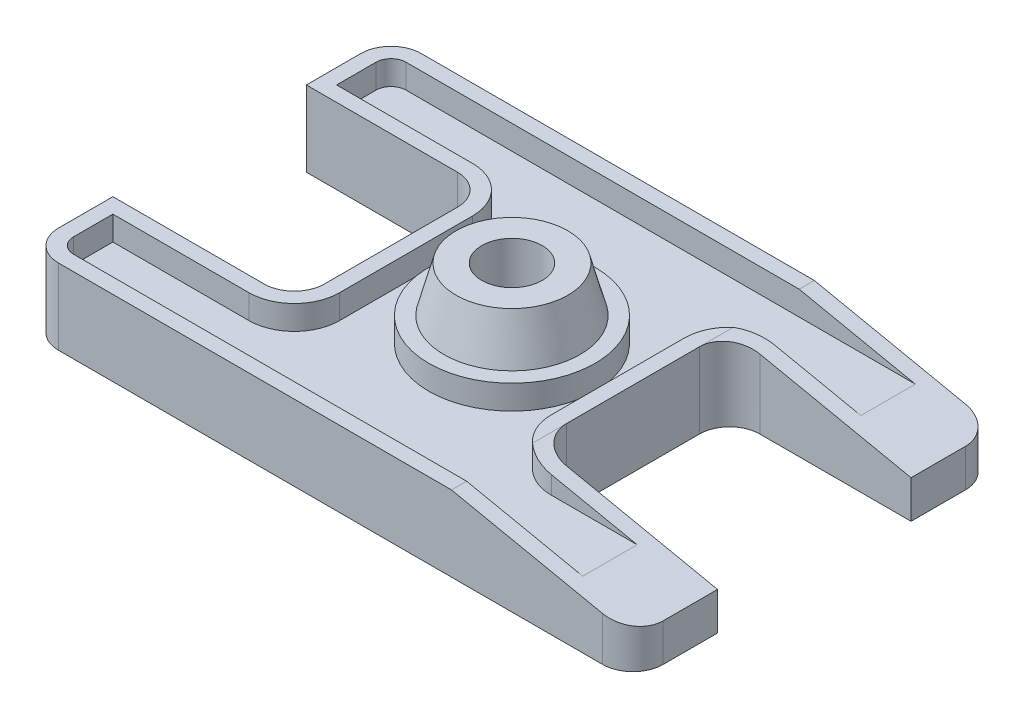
ISO-10303-21;
HEADER;
FILE_DESCRIPTION(('STEP AP214'),'2;1');
FILE_NAME('part.step','',(''),(''),'','','');
FILE_SCHEMA(('AUTOMOTIVE_DESIGN { 1 0 10303 214 1 1 1 1 }'));
ENDSEC;
DATA;
#1=APPLICATION_CONTEXT('core data for automotive mechanical design processes');
#2=APPLICATION_PROTOCOL_DEFINITION('international standard','automotive_design',2000,#1);
#3=PRODUCT_CONTEXT('',#1,'mechanical');
#4=PRODUCT('Part','Part','',(#3));
#5=PRODUCT_RELATED_PRODUCT_CATEGORY('part','',(#4));
#6=PRODUCT_DEFINITION_FORMATION('','',#4);
#7=PRODUCT_DEFINITION_CONTEXT('part definition',#1,'design');
#8=PRODUCT_DEFINITION('design','',#6,#7);
#9=PRODUCT_DEFINITION_SHAPE('','',#8);
#10=(LENGTH_UNIT() NAMED_UNIT(*) SI_UNIT(.MILLI.,.METRE.));
#11=(NAMED_UNIT(*) PLANE_ANGLE_UNIT() SI_UNIT($,.RADIAN.));
#12=(NAMED_UNIT(*) SI_UNIT($,.STERADIAN.) SOLID_ANGLE_UNIT());
#13=UNCERTAINTY_MEASURE_WITH_UNIT(LENGTH_MEASURE(1.E-05),#10,'distance_accuracy_value','');
#14=(GEOMETRIC_REPRESENTATION_CONTEXT(3) GLOBAL_UNCERTAINTY_ASSIGNED_CONTEXT((#13)) GLOBAL_UNIT_ASSIGNED_CONTEXT((#10,
#11,#12)) REPRESENTATION_CONTEXT('',''));
#15=CARTESIAN_POINT('',(0.,0.,0.));
#16=DIRECTION('',(0.,0.,1.));
#17=DIRECTION('',(1.,0.,0.));
#18=AXIS2_PLACEMENT_3D('',#15,#16,#17);
#19=CARTESIAN_POINT('',(-90.,25.,-50.));
#20=DIRECTION('',(0.,-1.,0.));
#21=DIRECTION('',(0.,0.,-1.));
#22=AXIS2_PLACEMENT_3D('',#19,#20,#21);
#23=PLANE('',#22);
#24=DIRECTION('',(1.,0.,0.));
#25=VECTOR('',#24,1.);
#26=CARTESIAN_POINT('',(-89.9999999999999,25.,60.));
#27=LINE('',#26,#25);
#28=CARTESIAN_POINT('',(-89.9999999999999,25.,60.));
#29=VERTEX_POINT('',#28);
#30=CARTESIAN_POINT('',(40.,25.,60.));
#31=VERTEX_POINT('',#30);
#32=EDGE_CURVE('E304',#29,#31,#27,.T.);
#33=ORIENTED_EDGE('',*,*,#32,.T.);
#34=DIRECTION('',(0.,0.,1.));
#35=VECTOR('',#34,1.);
#36=CARTESIAN_POINT('',(40.,25.,-60.));
#37=LINE('',#36,#35);
#38=CARTESIAN_POINT('',(40.,25.,55.));
#39=VERTEX_POINT('',#38);
#40=EDGE_CURVE('E285',#39,#31,#37,.T.);
#41=ORIENTED_EDGE('',*,*,#40,.F.);
#42=DIRECTION('',(1.,0.,0.));
#43=VECTOR('',#42,1.);
#44=CARTESIAN_POINT('',(-90.,25.,55.));
#45=LINE('',#44,#43);
#46=CARTESIAN_POINT('',(-90.,25.,55.));
#47=VERTEX_POINT('',#46);
#48=EDGE_CURVE('E511',#47,#39,#45,.T.);
#49=ORIENTED_EDGE('',*,*,#48,.F.);
#50=CARTESIAN_POINT('',(-90.,25.,50.));
#51=DIRECTION('',(0.,1.,0.));
#52=DIRECTION('',(0.,0.,1.));
#53=AXIS2_PLACEMENT_3D('',#50,#51,#52);
#54=CIRCLE('',#53,4.99999999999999);
#55=CARTESIAN_POINT('',(-95.,25.,49.9999999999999));
#56=VERTEX_POINT('',#55);
#57=EDGE_CURVE('E513',#56,#47,#54,.T.);
#58=ORIENTED_EDGE('',*,*,#57,.F.);
#59=DIRECTION('',(0.,0.,1.));
#60=VECTOR('',#59,1.);
#61=CARTESIAN_POINT('',(-95.,25.,37.));
#62=LINE('',#61,#60);
#63=CARTESIAN_POINT('',(-95.,25.,37.));
#64=VERTEX_POINT('',#63);
#65=EDGE_CURVE('E516',#64,#56,#62,.T.);
#66=ORIENTED_EDGE('',*,*,#65,.F.);
#67=DIRECTION('',(-1.,0.,0.));
#68=VECTOR('',#67,1.);
#69=CARTESIAN_POINT('',(-50.,25.,37.));
#70=LINE('',#69,#68);
#71=CARTESIAN_POINT('',(-50.,25.,37.));
#72=VERTEX_POINT('',#71);
#73=EDGE_CURVE('E519',#72,#64,#70,.T.);
#74=ORIENTED_EDGE('',*,*,#73,.F.);
#75=CARTESIAN_POINT('',(-50.,25.,22.));
#76=DIRECTION('',(0.,-1.,0.));
#77=DIRECTION('',(0.,0.,1.));
#78=AXIS2_PLACEMENT_3D('',#75,#76,#77);
#79=CIRCLE('',#78,15.);
#80=CARTESIAN_POINT('',(-35.,25.,22.));
#81=VERTEX_POINT('',#80);
#82=EDGE_CURVE('E522',#81,#72,#79,.T.);
#83=ORIENTED_EDGE('',*,*,#82,.F.);
#84=DIRECTION('',(0.,0.,1.));
#85=VECTOR('',#84,1.);
#86=CARTESIAN_POINT('',(-35.,25.,-22.));
#87=LINE('',#86,#85);
#88=CARTESIAN_POINT('',(-35.,25.,-22.));
#89=VERTEX_POINT('',#88);
#90=EDGE_CURVE('E525',#89,#81,#87,.T.);
#91=ORIENTED_EDGE('',*,*,#90,.F.);
#92=CARTESIAN_POINT('',(-50.,25.,-22.));
#93=DIRECTION('',(0.,-1.,0.));
#94=DIRECTION('',(0.,0.,1.));
#95=AXIS2_PLACEMENT_3D('',#92,#93,#94);
#96=CIRCLE('',#95,15.);
#97=CARTESIAN_POINT('',(-50.,25.,-37.));
#98=VERTEX_POINT('',#97);
#99=EDGE_CURVE('E528',#98,#89,#96,.T.);
#100=ORIENTED_EDGE('',*,*,#99,.F.);
#101=DIRECTION('',(1.,0.,0.));
#102=VECTOR('',#101,1.);
#103=CARTESIAN_POINT('',(-95.,25.,-37.));
#104=LINE('',#103,#102);
#105=CARTESIAN_POINT('',(-95.,25.,-37.));
#106=VERTEX_POINT('',#105);
#107=EDGE_CURVE('E531',#106,#98,#104,.T.);
#108=ORIENTED_EDGE('',*,*,#107,.F.);
#109=DIRECTION('',(0.,0.,1.));
#110=VECTOR('',#109,1.);
#111=CARTESIAN_POINT('',(-95.,25.,-50.));
#112=LINE('',#111,#110);
#113=CARTESIAN_POINT('',(-95.,25.,-50.));
#114=VERTEX_POINT('',#113);
#115=EDGE_CURVE('E534',#114,#106,#112,.T.);
#116=ORIENTED_EDGE('',*,*,#115,.F.);
#117=CARTESIAN_POINT('',(-90.,25.,-50.));
#118=DIRECTION('',(0.,1.,0.));
#119=DIRECTION('',(0.,0.,1.));
#120=AXIS2_PLACEMENT_3D('',#117,#118,#119);
#121=CIRCLE('',#120,5.);
#122=CARTESIAN_POINT('',(-90.,25.,-55.));
#123=VERTEX_POINT('',#122);
#124=EDGE_CURVE('E537',#123,#114,#121,.T.);
#125=ORIENTED_EDGE('',*,*,#124,.F.);
#126=DIRECTION('',(-1.,0.,0.));
#127=VECTOR('',#126,1.);
#128=CARTESIAN_POINT('',(90.,25.,-55.));
#129=LINE('',#128,#127);
#130=CARTESIAN_POINT('',(40.,25.,-55.));
#131=VERTEX_POINT('',#130);
#132=EDGE_CURVE('E500',#131,#123,#129,.T.);
#133=ORIENTED_EDGE('',*,*,#132,.F.);
#134=CARTESIAN_POINT('',(40.,25.,-60.));
#135=VERTEX_POINT('',#134);
#136=EDGE_CURVE('E299',#135,#131,#37,.T.);
#137=ORIENTED_EDGE('',*,*,#136,.F.);
#138=DIRECTION('',(1.,0.,0.));
#139=VECTOR('',#138,1.);
#140=CARTESIAN_POINT('',(-89.9999999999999,25.,-60.));
#141=LINE('',#140,#139);
#142=CARTESIAN_POINT('',(-89.9999999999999,25.,-60.));
#143=VERTEX_POINT('',#142);
#144=EDGE_CURVE('E317',#143,#135,#141,.T.);
#145=ORIENTED_EDGE('',*,*,#144,.F.);
#146=CARTESIAN_POINT('',(-90.,25.,-50.));
#147=DIRECTION('',(0.,-1.,0.));
#148=DIRECTION('',(0.,0.,-1.));
#149=AXIS2_PLACEMENT_3D('',#146,#147,#148);
#150=CIRCLE('',#149,10.);
#151=CARTESIAN_POINT('',(-100.,25.,-49.9999999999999));
#152=VERTEX_POINT('',#151);
#153=EDGE_CURVE('E397',#152,#143,#150,.T.);
#154=ORIENTED_EDGE('',*,*,#153,.F.);
#155=DIRECTION('',(0.,0.,-1.));
#156=VECTOR('',#155,1.);
#157=CARTESIAN_POINT('',(-100.,25.,-32.));
#158=LINE('',#157,#156);
#159=CARTESIAN_POINT('',(-100.,25.,-32.));
#160=VERTEX_POINT('',#159);
#161=EDGE_CURVE('E335',#160,#152,#158,.T.);
#162=ORIENTED_EDGE('',*,*,#161,.F.);
#163=DIRECTION('',(1.,0.,0.));
#164=VECTOR('',#163,1.);
#165=CARTESIAN_POINT('',(-100.,25.,-32.));
#166=LINE('',#165,#164);
#167=CARTESIAN_POINT('',(-50.,25.,-32.));
#168=VERTEX_POINT('',#167);
#169=EDGE_CURVE('E333',#160,#168,#166,.T.);
#170=ORIENTED_EDGE('',*,*,#169,.T.);
#171=CARTESIAN_POINT('',(-50.,25.,-22.));
#172=DIRECTION('',(0.,-1.,0.));
#173=DIRECTION('',(0.,0.,-1.));
#174=AXIS2_PLACEMENT_3D('',#171,#172,#173);
#175=CIRCLE('',#174,10.);
#176=CARTESIAN_POINT('',(-40.,25.,-22.));
#177=VERTEX_POINT('',#176);
#178=EDGE_CURVE('E331',#168,#177,#175,.T.);
#179=ORIENTED_EDGE('',*,*,#178,.T.);
#180=DIRECTION('',(0.,0.,1.));
#181=VECTOR('',#180,1.);
#182=CARTESIAN_POINT('',(-40.,25.,-22.));
#183=LINE('',#182,#181);
#184=CARTESIAN_POINT('',(-40.,25.,22.));
#185=VERTEX_POINT('',#184);
#186=EDGE_CURVE('E329',#177,#185,#183,.T.);
#187=ORIENTED_EDGE('',*,*,#186,.T.);
#188=CARTESIAN_POINT('',(-50.,25.,22.));
#189=DIRECTION('',(0.,1.,0.));
#190=DIRECTION('',(0.,0.,1.));
#191=AXIS2_PLACEMENT_3D('',#188,#189,#190);
#192=CIRCLE('',#191,10.);
#193=CARTESIAN_POINT('',(-50.,25.,32.));
#194=VERTEX_POINT('',#193);
#195=EDGE_CURVE('E326',#194,#185,#192,.T.);
#196=ORIENTED_EDGE('',*,*,#195,.F.);
#197=DIRECTION('',(1.,0.,0.));
#198=VECTOR('',#197,1.);
#199=CARTESIAN_POINT('',(-100.,25.,32.));
#200=LINE('',#199,#198);
#201=CARTESIAN_POINT('',(-100.,25.,32.));
#202=VERTEX_POINT('',#201);
#203=EDGE_CURVE('E323',#202,#194,#200,.T.);
#204=ORIENTED_EDGE('',*,*,#203,.F.);
#205=DIRECTION('',(0.,0.,-1.));
#206=VECTOR('',#205,1.);
#207=CARTESIAN_POINT('',(-100.,25.,49.9999999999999));
#208=LINE('',#207,#206);
#209=CARTESIAN_POINT('',(-100.,25.,49.9999999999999));
#210=VERTEX_POINT('',#209);
#211=EDGE_CURVE('E314',#210,#202,#208,.T.);
#212=ORIENTED_EDGE('',*,*,#211,.F.);
#213=CARTESIAN_POINT('',(-90.,25.,50.));
#214=DIRECTION('',(0.,-1.,0.));
#215=DIRECTION('',(0.,0.,-1.));
#216=AXIS2_PLACEMENT_3D('',#213,#214,#215);
#217=CIRCLE('',#216,10.);
#218=EDGE_CURVE('E311',#29,#210,#217,.T.);
#219=ORIENTED_EDGE('',*,*,#218,.F.);
#220=EDGE_LOOP('',(#33,#41,#49,#58,#66,#74,#83,#91,#100,#108,#116,#125,#133,#137,#145,#154,#162,
#170,#179,#187,#196,#204,#212,#219));
#221=FACE_BOUND('',#220,.T.);
#222=ADVANCED_FACE('F37',(#221),#23,.F.);
#223=CARTESIAN_POINT('',(-90.,0.,-50.));
#224=DIRECTION('',(0.,-1.,0.));
#225=DIRECTION('',(0.,0.,-1.));
#226=AXIS2_PLACEMENT_3D('',#223,#224,#225);
#227=PLANE('',#226);
#228=CARTESIAN_POINT('',(-90.,0.,-50.));
#229=DIRECTION('',(0.,-1.,0.));
#230=DIRECTION('',(0.,0.,-1.));
#231=AXIS2_PLACEMENT_3D('',#228,#229,#230);
#232=CIRCLE('',#231,10.);
#233=CARTESIAN_POINT('',(-100.,0.,-49.9999999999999));
#234=VERTEX_POINT('',#233);
#235=CARTESIAN_POINT('',(-89.9999999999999,0.,-60.));
#236=VERTEX_POINT('',#235);
#237=EDGE_CURVE('E339',#234,#236,#232,.T.);
#238=ORIENTED_EDGE('',*,*,#237,.T.);
#239=DIRECTION('',(1.,0.,0.));
#240=VECTOR('',#239,1.);
#241=CARTESIAN_POINT('',(-89.9999999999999,0.,-60.));
#242=LINE('',#241,#240);
#243=CARTESIAN_POINT('',(89.9999999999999,0.,-60.));
#244=VERTEX_POINT('',#243);
#245=EDGE_CURVE('E342',#236,#244,#242,.T.);
#246=ORIENTED_EDGE('',*,*,#245,.T.);
#247=CARTESIAN_POINT('',(90.,0.,-50.));
#248=DIRECTION('',(0.,-1.,0.));
#249=DIRECTION('',(0.,0.,-1.));
#250=AXIS2_PLACEMENT_3D('',#247,#248,#249);
#251=CIRCLE('',#250,10.);
#252=CARTESIAN_POINT('',(100.,0.,-49.9999999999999));
#253=VERTEX_POINT('',#252);
#254=EDGE_CURVE('E346',#244,#253,#251,.T.);
#255=ORIENTED_EDGE('',*,*,#254,.T.);
#256=DIRECTION('',(0.,0.,-1.));
#257=VECTOR('',#256,1.);
#258=CARTESIAN_POINT('',(100.,0.,-32.));
#259=LINE('',#258,#257);
#260=CARTESIAN_POINT('',(100.,0.,-32.));
#261=VERTEX_POINT('',#260);
#262=EDGE_CURVE('E349',#261,#253,#259,.T.);
#263=ORIENTED_EDGE('',*,*,#262,.F.);
#264=DIRECTION('',(-1.,0.,0.));
#265=VECTOR('',#264,1.);
#266=CARTESIAN_POINT('',(100.,0.,-32.));
#267=LINE('',#266,#265);
#268=CARTESIAN_POINT('',(50.,0.,-32.));
#269=VERTEX_POINT('',#268);
#270=EDGE_CURVE('E352',#261,#269,#267,.T.);
#271=ORIENTED_EDGE('',*,*,#270,.T.);
#272=CARTESIAN_POINT('',(50.,0.,-22.));
#273=DIRECTION('',(0.,1.,0.));
#274=DIRECTION('',(0.,0.,1.));
#275=AXIS2_PLACEMENT_3D('',#272,#273,#274);
#276=CIRCLE('',#275,10.);
#277=CARTESIAN_POINT('',(40.,0.,-22.));
#278=VERTEX_POINT('',#277);
#279=EDGE_CURVE('E355',#269,#278,#276,.T.);
#280=ORIENTED_EDGE('',*,*,#279,.T.);
#281=DIRECTION('',(0.,0.,1.));
#282=VECTOR('',#281,1.);
#283=CARTESIAN_POINT('',(40.,0.,-22.));
#284=LINE('',#283,#282);
#285=CARTESIAN_POINT('',(40.,0.,22.));
#286=VERTEX_POINT('',#285);
#287=EDGE_CURVE('E358',#278,#286,#284,.T.);
#288=ORIENTED_EDGE('',*,*,#287,.T.);
#289=CARTESIAN_POINT('',(50.,0.,22.));
#290=DIRECTION('',(0.,-1.,0.));
#291=DIRECTION('',(0.,0.,-1.));
#292=AXIS2_PLACEMENT_3D('',#289,#290,#291);
#293=CIRCLE('',#292,10.);
#294=CARTESIAN_POINT('',(50.,0.,32.));
#295=VERTEX_POINT('',#294);
#296=EDGE_CURVE('E361',#295,#286,#293,.T.);
#297=ORIENTED_EDGE('',*,*,#296,.F.);
#298=DIRECTION('',(-1.,0.,0.));
#299=VECTOR('',#298,1.);
#300=CARTESIAN_POINT('',(100.,0.,32.));
#301=LINE('',#300,#299);
#302=CARTESIAN_POINT('',(100.,0.,32.));
#303=VERTEX_POINT('',#302);
#304=EDGE_CURVE('E364',#303,#295,#301,.T.);
#305=ORIENTED_EDGE('',*,*,#304,.F.);
#306=DIRECTION('',(0.,0.,-1.));
#307=VECTOR('',#306,1.);
#308=CARTESIAN_POINT('',(100.,0.,49.9999999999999));
#309=LINE('',#308,#307);
#310=CARTESIAN_POINT('',(100.,0.,49.9999999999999));
#311=VERTEX_POINT('',#310);
#312=EDGE_CURVE('E367',#311,#303,#309,.T.);
#313=ORIENTED_EDGE('',*,*,#312,.F.);
#314=CARTESIAN_POINT('',(90.,0.,50.));
#315=DIRECTION('',(0.,1.,0.));
#316=DIRECTION('',(0.,0.,1.));
#317=AXIS2_PLACEMENT_3D('',#314,#315,#316);
#318=CIRCLE('',#317,10.);
#319=CARTESIAN_POINT('',(89.9999999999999,0.,60.));
#320=VERTEX_POINT('',#319);
#321=EDGE_CURVE('E370',#320,#311,#318,.T.);
#322=ORIENTED_EDGE('',*,*,#321,.F.);
#323=DIRECTION('',(1.,0.,0.));
#324=VECTOR('',#323,1.);
#325=CARTESIAN_POINT('',(-89.9999999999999,0.,60.));
#326=LINE('',#325,#324);
#327=CARTESIAN_POINT('',(-89.9999999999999,0.,60.));
#328=VERTEX_POINT('',#327);
#329=EDGE_CURVE('E373',#328,#320,#326,.T.);
#330=ORIENTED_EDGE('',*,*,#329,.F.);
#331=CARTESIAN_POINT('',(-90.,0.,50.));
#332=DIRECTION('',(0.,-1.,0.));
#333=DIRECTION('',(0.,0.,-1.));
#334=AXIS2_PLACEMENT_3D('',#331,#332,#333);
#335=CIRCLE('',#334,10.);
#336=CARTESIAN_POINT('',(-100.,0.,49.9999999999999));
#337=VERTEX_POINT('',#336);
#338=EDGE_CURVE('E375',#328,#337,#335,.T.);
#339=ORIENTED_EDGE('',*,*,#338,.T.);
#340=DIRECTION('',(0.,0.,-1.));
#341=VECTOR('',#340,1.);
#342=CARTESIAN_POINT('',(-100.,0.,49.9999999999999));
#343=LINE('',#342,#341);
#344=CARTESIAN_POINT('',(-100.,0.,32.));
#345=VERTEX_POINT('',#344);
#346=EDGE_CURVE('E378',#337,#345,#343,.T.);
#347=ORIENTED_EDGE('',*,*,#346,.T.);
#348=DIRECTION('',(1.,0.,0.));
#349=VECTOR('',#348,1.);
#350=CARTESIAN_POINT('',(-100.,0.,32.));
#351=LINE('',#350,#349);
#352=CARTESIAN_POINT('',(-50.,0.,32.));
#353=VERTEX_POINT('',#352);
#354=EDGE_CURVE('E381',#345,#353,#351,.T.);
#355=ORIENTED_EDGE('',*,*,#354,.T.);
#356=CARTESIAN_POINT('',(-50.,0.,22.));
#357=DIRECTION('',(0.,1.,0.));
#358=DIRECTION('',(0.,0.,1.));
#359=AXIS2_PLACEMENT_3D('',#356,#357,#358);
#360=CIRCLE('',#359,10.);
#361=CARTESIAN_POINT('',(-40.,0.,22.));
#362=VERTEX_POINT('',#361);
#363=EDGE_CURVE('E384',#353,#362,#360,.T.);
#364=ORIENTED_EDGE('',*,*,#363,.T.);
#365=DIRECTION('',(0.,0.,1.));
#366=VECTOR('',#365,1.);
#367=CARTESIAN_POINT('',(-40.,0.,-22.));
#368=LINE('',#367,#366);
#369=CARTESIAN_POINT('',(-40.,0.,-22.));
#370=VERTEX_POINT('',#369);
#371=EDGE_CURVE('E387',#370,#362,#368,.T.);
#372=ORIENTED_EDGE('',*,*,#371,.F.);
#373=CARTESIAN_POINT('',(-50.,0.,-22.));
#374=DIRECTION('',(0.,-1.,0.));
#375=DIRECTION('',(0.,0.,-1.));
#376=AXIS2_PLACEMENT_3D('',#373,#374,#375);
#377=CIRCLE('',#376,10.);
#378=CARTESIAN_POINT('',(-50.,0.,-32.));
#379=VERTEX_POINT('',#378);
#380=EDGE_CURVE('E390',#379,#370,#377,.T.);
#381=ORIENTED_EDGE('',*,*,#380,.F.);
#382=DIRECTION('',(1.,0.,0.));
#383=VECTOR('',#382,1.);
#384=CARTESIAN_POINT('',(-100.,0.,-32.));
#385=LINE('',#384,#383);
#386=CARTESIAN_POINT('',(-100.,0.,-32.));
#387=VERTEX_POINT('',#386);
#388=EDGE_CURVE('E392',#387,#379,#385,.T.);
#389=ORIENTED_EDGE('',*,*,#388,.F.);
#390=DIRECTION('',(0.,0.,-1.));
#391=VECTOR('',#390,1.);
#392=CARTESIAN_POINT('',(-100.,0.,-32.));
#393=LINE('',#392,#391);
#394=EDGE_CURVE('E394',#387,#234,#393,.T.);
#395=ORIENTED_EDGE('',*,*,#394,.T.);
#396=EDGE_LOOP('',(#238,#246,#255,#263,#271,#280,#288,#297,#305,#313,#322,#330,#339,#347,#355,
#364,#372,#381,#389,#395));
#397=FACE_BOUND('',#396,.T.);
#398=CARTESIAN_POINT('',(0.,0.,0.));
#399=DIRECTION('',(0.,1.,0.));
#400=DIRECTION('',(0.,0.,1.));
#401=AXIS2_PLACEMENT_3D('',#398,#399,#400);
#402=CIRCLE('',#401,10.);
#403=CARTESIAN_POINT('',(0.,0.,10.));
#404=VERTEX_POINT('',#403);
#405=EDGE_CURVE('E590',#404,#404,#402,.T.);
#406=ORIENTED_EDGE('',*,*,#405,.T.);
#407=EDGE_LOOP('',(#406));
#408=FACE_BOUND('',#407,.T.);
#409=ADVANCED_FACE('F449',(#397,#408),#227,.T.);
#410=CARTESIAN_POINT('',(0.,40.,0.));
#411=DIRECTION('',(0.,-1.,0.));
#412=DIRECTION('',(0.,0.,-1.));
#413=AXIS2_PLACEMENT_3D('',#410,#411,#412);
#414=PLANE('',#413);
#415=CARTESIAN_POINT('',(0.,40.,0.));
#416=DIRECTION('',(0.,-1.,0.));
#417=DIRECTION('',(0.,0.,-1.));
#418=AXIS2_PLACEMENT_3D('',#415,#416,#417);
#419=CIRCLE('',#418,18.4807621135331);
#420=CARTESIAN_POINT('',(0.,40.,-18.4807621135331));
#421=VERTEX_POINT('',#420);
#422=EDGE_CURVE('E343',#421,#421,#419,.T.);
#423=ORIENTED_EDGE('',*,*,#422,.F.);
#424=EDGE_LOOP('',(#423));
#425=FACE_BOUND('',#424,.T.);
#426=CARTESIAN_POINT('',(0.,40.,0.));
#427=DIRECTION('',(0.,1.,0.));
#428=DIRECTION('',(0.,0.,1.));
#429=AXIS2_PLACEMENT_3D('',#426,#427,#428);
#430=CIRCLE('',#429,10.);
#431=CARTESIAN_POINT('',(0.,40.,10.));
#432=VERTEX_POINT('',#431);
#433=EDGE_CURVE('E587',#432,#432,#430,.T.);
#434=ORIENTED_EDGE('',*,*,#433,.F.);
#435=EDGE_LOOP('',(#434));
#436=FACE_BOUND('',#435,.T.);
#437=ADVANCED_FACE('F705',(#425,#436),#414,.F.);
#438=CARTESIAN_POINT('',(-90.,25.,-50.));
#439=DIRECTION('',(0.,-1.,0.));
#440=DIRECTION('',(0.,0.,-1.));
#441=AXIS2_PLACEMENT_3D('',#438,#439,#440);
#442=CYLINDRICAL_SURFACE('',#441,10.);
#443=ORIENTED_EDGE('',*,*,#237,.F.);
#444=DIRECTION('',(0.,-1.,0.));
#445=VECTOR('',#444,1.);
#446=CARTESIAN_POINT('',(-100.,25.,-49.9999999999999));
#447=LINE('',#446,#445);
#448=EDGE_CURVE('E398',#152,#234,#447,.T.);
#449=ORIENTED_EDGE('',*,*,#448,.F.);
#450=ORIENTED_EDGE('',*,*,#153,.T.);
#451=DIRECTION('',(0.,-1.,0.));
#452=VECTOR('',#451,1.);
#453=CARTESIAN_POINT('',(-89.9999999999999,25.,-60.));
#454=LINE('',#453,#452);
#455=EDGE_CURVE('E338',#143,#236,#454,.T.);
#456=ORIENTED_EDGE('',*,*,#455,.T.);
#457=EDGE_LOOP('',(#443,#449,#450,#456));
#458=FACE_BOUND('',#457,.T.);
#459=ADVANCED_FACE('F39',(#458),#442,.T.);
#460=CARTESIAN_POINT('',(-100.,25.,-32.));
#461=DIRECTION('',(-1.,0.,0.));
#462=DIRECTION('',(0.,0.,1.));
#463=AXIS2_PLACEMENT_3D('',#460,#461,#462);
#464=PLANE('',#463);
#465=ORIENTED_EDGE('',*,*,#394,.F.);
#466=DIRECTION('',(0.,-1.,0.));
#467=VECTOR('',#466,1.);
#468=CARTESIAN_POINT('',(-100.,25.,-32.));
#469=LINE('',#468,#467);
#470=EDGE_CURVE('E400',#160,#387,#469,.T.);
#471=ORIENTED_EDGE('',*,*,#470,.F.);
#472=ORIENTED_EDGE('',*,*,#161,.T.);
#473=ORIENTED_EDGE('',*,*,#448,.T.);
#474=EDGE_LOOP('',(#465,#471,#472,#473));
#475=FACE_BOUND('',#474,.T.);
#476=ADVANCED_FACE('F455',(#475),#464,.T.);
#477=CARTESIAN_POINT('',(-100.,25.,-32.));
#478=DIRECTION('',(0.,0.,-1.));
#479=DIRECTION('',(-1.,0.,0.));
#480=AXIS2_PLACEMENT_3D('',#477,#478,#479);
#481=PLANE('',#480);
#482=ORIENTED_EDGE('',*,*,#388,.T.);
#483=DIRECTION('',(0.,-1.,0.));
#484=VECTOR('',#483,1.);
#485=CARTESIAN_POINT('',(-50.,25.,-32.));
#486=LINE('',#485,#484);
#487=EDGE_CURVE('E402',#168,#379,#486,.T.);
#488=ORIENTED_EDGE('',*,*,#487,.F.);
#489=ORIENTED_EDGE('',*,*,#169,.F.);
#490=ORIENTED_EDGE('',*,*,#470,.T.);
#491=EDGE_LOOP('',(#482,#488,#489,#490));
#492=FACE_BOUND('',#491,.T.);
#493=ADVANCED_FACE('F689',(#492),#481,.F.);
#494=CARTESIAN_POINT('',(-50.,25.,-22.));
#495=DIRECTION('',(0.,-1.,0.));
#496=DIRECTION('',(0.,0.,-1.));
#497=AXIS2_PLACEMENT_3D('',#494,#495,#496);
#498=CYLINDRICAL_SURFACE('',#497,10.);
#499=ORIENTED_EDGE('',*,*,#380,.T.);
#500=DIRECTION('',(0.,-1.,0.));
#501=VECTOR('',#500,1.);
#502=CARTESIAN_POINT('',(-40.,25.,-22.));
#503=LINE('',#502,#501);
#504=EDGE_CURVE('E405',#177,#370,#503,.T.);
#505=ORIENTED_EDGE('',*,*,#504,.F.);
#506=ORIENTED_EDGE('',*,*,#178,.F.);
#507=ORIENTED_EDGE('',*,*,#487,.T.);
#508=EDGE_LOOP('',(#499,#505,#506,#507));
#509=FACE_BOUND('',#508,.T.);
#510=ADVANCED_FACE('F685',(#509),#498,.F.);
#511=CARTESIAN_POINT('',(-40.,25.,-22.));
#512=DIRECTION('',(1.,0.,0.));
#513=DIRECTION('',(0.,0.,-1.));
#514=AXIS2_PLACEMENT_3D('',#511,#512,#513);
#515=PLANE('',#514);
#516=ORIENTED_EDGE('',*,*,#371,.T.);
#517=DIRECTION('',(0.,-1.,0.));
#518=VECTOR('',#517,1.);
#519=CARTESIAN_POINT('',(-40.,25.,22.));
#520=LINE('',#519,#518);
#521=EDGE_CURVE('E408',#185,#362,#520,.T.);
#522=ORIENTED_EDGE('',*,*,#521,.F.);
#523=ORIENTED_EDGE('',*,*,#186,.F.);
#524=ORIENTED_EDGE('',*,*,#504,.T.);
#525=EDGE_LOOP('',(#516,#522,#523,#524));
#526=FACE_BOUND('',#525,.T.);
#527=ADVANCED_FACE('F682',(#526),#515,.F.);
#528=CARTESIAN_POINT('',(-50.,25.,22.));
#529=DIRECTION('',(0.,-1.,0.));
#530=DIRECTION('',(0.,0.,-1.));
#531=AXIS2_PLACEMENT_3D('',#528,#529,#530);
#532=CYLINDRICAL_SURFACE('',#531,10.);
#533=ORIENTED_EDGE('',*,*,#363,.F.);
#534=DIRECTION('',(0.,-1.,0.));
#535=VECTOR('',#534,1.);
#536=CARTESIAN_POINT('',(-50.,25.,32.));
#537=LINE('',#536,#535);
#538=EDGE_CURVE('E410',#194,#353,#537,.T.);
#539=ORIENTED_EDGE('',*,*,#538,.F.);
#540=ORIENTED_EDGE('',*,*,#195,.T.);
#541=ORIENTED_EDGE('',*,*,#521,.T.);
#542=EDGE_LOOP('',(#533,#539,#540,#541));
#543=FACE_BOUND('',#542,.T.);
#544=ADVANCED_FACE('F678',(#543),#532,.F.);
#545=CARTESIAN_POINT('',(-100.,25.,32.));
#546=DIRECTION('',(0.,0.,-1.));
#547=DIRECTION('',(-1.,0.,0.));
#548=AXIS2_PLACEMENT_3D('',#545,#546,#547);
#549=PLANE('',#548);
#550=ORIENTED_EDGE('',*,*,#354,.F.);
#551=DIRECTION('',(0.,-1.,0.));
#552=VECTOR('',#551,1.);
#553=CARTESIAN_POINT('',(-100.,25.,32.));
#554=LINE('',#553,#552);
#555=EDGE_CURVE('E412',#202,#345,#554,.T.);
#556=ORIENTED_EDGE('',*,*,#555,.F.);
#557=ORIENTED_EDGE('',*,*,#203,.T.);
#558=ORIENTED_EDGE('',*,*,#538,.T.);
#559=EDGE_LOOP('',(#550,#556,#557,#558));
#560=FACE_BOUND('',#559,.T.);
#561=ADVANCED_FACE('F674',(#560),#549,.T.);
#562=CARTESIAN_POINT('',(-100.,25.,49.9999999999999));
#563=DIRECTION('',(-1.,0.,0.));
#564=DIRECTION('',(0.,0.,1.));
#565=AXIS2_PLACEMENT_3D('',#562,#563,#564);
#566=PLANE('',#565);
#567=ORIENTED_EDGE('',*,*,#346,.F.);
#568=DIRECTION('',(0.,-1.,0.));
#569=VECTOR('',#568,1.);
#570=CARTESIAN_POINT('',(-100.,25.,49.9999999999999));
#571=LINE('',#570,#569);
#572=EDGE_CURVE('E414',#210,#337,#571,.T.);
#573=ORIENTED_EDGE('',*,*,#572,.F.);
#574=ORIENTED_EDGE('',*,*,#211,.T.);
#575=ORIENTED_EDGE('',*,*,#555,.T.);
#576=EDGE_LOOP('',(#567,#573,#574,#575));
#577=FACE_BOUND('',#576,.T.);
#578=ADVANCED_FACE('F669',(#577),#566,.T.);
#579=CARTESIAN_POINT('',(-90.,25.,50.));
#580=DIRECTION('',(0.,-1.,0.));
#581=DIRECTION('',(0.,0.,-1.));
#582=AXIS2_PLACEMENT_3D('',#579,#580,#581);
#583=CYLINDRICAL_SURFACE('',#582,10.);
#584=ORIENTED_EDGE('',*,*,#338,.F.);
#585=DIRECTION('',(0.,-1.,0.));
#586=VECTOR('',#585,1.);
#587=CARTESIAN_POINT('',(-89.9999999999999,25.,60.));
#588=LINE('',#587,#586);
#589=EDGE_CURVE('E416',#29,#328,#588,.T.);
#590=ORIENTED_EDGE('',*,*,#589,.F.);
#591=ORIENTED_EDGE('',*,*,#218,.T.);
#592=ORIENTED_EDGE('',*,*,#572,.T.);
#593=EDGE_LOOP('',(#584,#590,#591,#592));
#594=FACE_BOUND('',#593,.T.);
#595=ADVANCED_FACE('F666',(#594),#583,.T.);
#596=CARTESIAN_POINT('',(-89.9999999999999,25.,60.));
#597=DIRECTION('',(0.,0.,-1.));
#598=DIRECTION('',(-1.,0.,0.));
#599=AXIS2_PLACEMENT_3D('',#596,#597,#598);
#600=PLANE('',#599);
#601=DIRECTION('',(0.,-1.,0.));
#602=VECTOR('',#601,1.);
#603=CARTESIAN_POINT('',(89.9999999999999,25.,60.));
#604=LINE('',#603,#602);
#605=CARTESIAN_POINT('',(90.,14.5833333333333,60.));
#606=VERTEX_POINT('',#605);
#607=EDGE_CURVE('E307',#606,#320,#604,.T.);
#608=ORIENTED_EDGE('',*,*,#607,.F.);
#609=DIRECTION('',(0.978980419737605,-0.203954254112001,0.));
#610=VECTOR('',#609,1.);
#611=CARTESIAN_POINT('',(40.,25.,60.));
#612=LINE('',#611,#610);
#613=EDGE_CURVE('E288',#31,#606,#612,.T.);
#614=ORIENTED_EDGE('',*,*,#613,.F.);
#615=ORIENTED_EDGE('',*,*,#32,.F.);
#616=ORIENTED_EDGE('',*,*,#589,.T.);
#617=ORIENTED_EDGE('',*,*,#329,.T.);
#618=EDGE_LOOP('',(#608,#614,#615,#616,#617));
#619=FACE_BOUND('',#618,.T.);
#620=ADVANCED_FACE('F303',(#619),#600,.F.);
#621=CARTESIAN_POINT('',(90.,25.,50.));
#622=DIRECTION('',(0.,-1.,0.));
#623=DIRECTION('',(0.,0.,-1.));
#624=AXIS2_PLACEMENT_3D('',#621,#622,#623);
#625=CYLINDRICAL_SURFACE('',#624,10.);
#626=DIRECTION('',(0.,-1.,0.));
#627=VECTOR('',#626,1.);
#628=CARTESIAN_POINT('',(100.,25.,49.9999999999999));
#629=LINE('',#628,#627);
#630=CARTESIAN_POINT('',(100.,12.5,50.));
#631=VERTEX_POINT('',#630);
#632=EDGE_CURVE('E419',#631,#311,#629,.T.);
#633=ORIENTED_EDGE('',*,*,#632,.F.);
#634=CARTESIAN_POINT('',(90.,14.5833333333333,50.));
#635=DIRECTION('',(-0.203954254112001,-0.978980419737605,0.));
#636=DIRECTION('',(0.978980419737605,-0.203954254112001,0.));
#637=AXIS2_PLACEMENT_3D('',#634,#635,#636);
#638=ELLIPSE('',#637,10.2147088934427,10.);
#639=EDGE_CURVE('E593',#631,#606,#638,.T.);
#640=ORIENTED_EDGE('',*,*,#639,.T.);
#641=ORIENTED_EDGE('',*,*,#607,.T.);
#642=ORIENTED_EDGE('',*,*,#321,.T.);
#643=EDGE_LOOP('',(#633,#640,#641,#642));
#644=FACE_BOUND('',#643,.T.);
#645=ADVANCED_FACE('F663',(#644),#625,.T.);
#646=CARTESIAN_POINT('',(100.,25.,49.9999999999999));
#647=DIRECTION('',(-1.,0.,0.));
#648=DIRECTION('',(0.,0.,1.));
#649=AXIS2_PLACEMENT_3D('',#646,#647,#648);
#650=PLANE('',#649);
#651=DIRECTION('',(0.,-1.,0.));
#652=VECTOR('',#651,1.);
#653=CARTESIAN_POINT('',(100.,25.,32.));
#654=LINE('',#653,#652);
#655=CARTESIAN_POINT('',(100.,12.5,32.));
#656=VERTEX_POINT('',#655);
#657=EDGE_CURVE('E421',#656,#303,#654,.T.);
#658=ORIENTED_EDGE('',*,*,#657,.F.);
#659=DIRECTION('',(0.,0.,1.));
#660=VECTOR('',#659,1.);
#661=CARTESIAN_POINT('',(100.,12.5,-60.));
#662=LINE('',#661,#660);
#663=EDGE_CURVE('E622',#656,#631,#662,.T.);
#664=ORIENTED_EDGE('',*,*,#663,.T.);
#665=ORIENTED_EDGE('',*,*,#632,.T.);
#666=ORIENTED_EDGE('',*,*,#312,.T.);
#667=EDGE_LOOP('',(#658,#664,#665,#666));
#668=FACE_BOUND('',#667,.T.);
#669=ADVANCED_FACE('F660',(#668),#650,.F.);
#670=CARTESIAN_POINT('',(100.,25.,32.));
#671=DIRECTION('',(0.,0.,1.));
#672=DIRECTION('',(1.,0.,0.));
#673=AXIS2_PLACEMENT_3D('',#670,#671,#672);
#674=PLANE('',#673);
#675=DIRECTION('',(0.,-1.,0.));
#676=VECTOR('',#675,1.);
#677=CARTESIAN_POINT('',(50.,25.,32.));
#678=LINE('',#677,#676);
#679=CARTESIAN_POINT('',(50.,22.9166666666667,32.));
#680=VERTEX_POINT('',#679);
#681=EDGE_CURVE('E423',#680,#295,#678,.T.);
#682=ORIENTED_EDGE('',*,*,#681,.F.);
#683=DIRECTION('',(0.978980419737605,-0.203954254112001,0.));
#684=VECTOR('',#683,1.);
#685=CARTESIAN_POINT('',(97.5041597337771,13.0199667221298,32.));
#686=LINE('',#685,#684);
#687=EDGE_CURVE('E597',#680,#656,#686,.T.);
#688=ORIENTED_EDGE('',*,*,#687,.T.);
#689=ORIENTED_EDGE('',*,*,#657,.T.);
#690=ORIENTED_EDGE('',*,*,#304,.T.);
#691=EDGE_LOOP('',(#682,#688,#689,#690));
#692=FACE_BOUND('',#691,.T.);
#693=ADVANCED_FACE('F654',(#692),#674,.F.);
#694=CARTESIAN_POINT('',(50.,25.,22.));
#695=DIRECTION('',(0.,-1.,0.));
#696=DIRECTION('',(0.,0.,-1.));
#697=AXIS2_PLACEMENT_3D('',#694,#695,#696);
#698=CYLINDRICAL_SURFACE('',#697,10.);
#699=DIRECTION('',(0.,-1.,0.));
#700=VECTOR('',#699,1.);
#701=CARTESIAN_POINT('',(40.,25.,22.));
#702=LINE('',#701,#700);
#703=CARTESIAN_POINT('',(40.,25.,22.));
#704=VERTEX_POINT('',#703);
#705=EDGE_CURVE('E425',#704,#286,#702,.T.);
#706=ORIENTED_EDGE('',*,*,#705,.F.);
#707=CARTESIAN_POINT('',(50.,22.9166666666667,22.));
#708=DIRECTION('',(-0.203954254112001,-0.978980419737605,0.));
#709=DIRECTION('',(0.978980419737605,-0.203954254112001,0.));
#710=AXIS2_PLACEMENT_3D('',#707,#708,#709);
#711=ELLIPSE('',#710,10.2147088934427,10.);
#712=EDGE_CURVE('E600',#704,#680,#711,.F.);
#713=ORIENTED_EDGE('',*,*,#712,.T.);
#714=ORIENTED_EDGE('',*,*,#681,.T.);
#715=ORIENTED_EDGE('',*,*,#296,.T.);
#716=EDGE_LOOP('',(#706,#713,#714,#715));
#717=FACE_BOUND('',#716,.T.);
#718=ADVANCED_FACE('F651',(#717),#698,.F.);
#719=CARTESIAN_POINT('',(40.,25.,-22.));
#720=DIRECTION('',(1.,0.,0.));
#721=DIRECTION('',(0.,0.,-1.));
#722=AXIS2_PLACEMENT_3D('',#719,#720,#721);
#723=PLANE('',#722);
#724=ORIENTED_EDGE('',*,*,#287,.F.);
#725=DIRECTION('',(0.,-1.,0.));
#726=VECTOR('',#725,1.);
#727=CARTESIAN_POINT('',(40.,25.,-22.));
#728=LINE('',#727,#726);
#729=CARTESIAN_POINT('',(40.,25.,-22.));
#730=VERTEX_POINT('',#729);
#731=EDGE_CURVE('E427',#730,#278,#728,.T.);
#732=ORIENTED_EDGE('',*,*,#731,.F.);
#733=DIRECTION('',(0.,0.,1.));
#734=VECTOR('',#733,1.);
#735=CARTESIAN_POINT('',(40.,25.,-22.));
#736=LINE('',#735,#734);
#737=EDGE_CURVE('E312',#730,#704,#736,.T.);
#738=ORIENTED_EDGE('',*,*,#737,.T.);
#739=ORIENTED_EDGE('',*,*,#705,.T.);
#740=EDGE_LOOP('',(#724,#732,#738,#739));
#741=FACE_BOUND('',#740,.T.);
#742=ADVANCED_FACE('F647',(#741),#723,.T.);
#743=CARTESIAN_POINT('',(50.,25.,-22.));
#744=DIRECTION('',(0.,-1.,0.));
#745=DIRECTION('',(0.,0.,-1.));
#746=AXIS2_PLACEMENT_3D('',#743,#744,#745);
#747=CYLINDRICAL_SURFACE('',#746,10.);
#748=CARTESIAN_POINT('',(50.,22.9166666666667,-22.));
#749=DIRECTION('',(-0.203954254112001,-0.978980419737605,0.));
#750=DIRECTION('',(0.978980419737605,-0.203954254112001,0.));
#751=AXIS2_PLACEMENT_3D('',#748,#749,#750);
#752=ELLIPSE('',#751,10.2147088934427,10.);
#753=CARTESIAN_POINT('',(50.,22.9166666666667,-32.));
#754=VERTEX_POINT('',#753);
#755=EDGE_CURVE('E603',#730,#754,#752,.T.);
#756=ORIENTED_EDGE('',*,*,#755,.F.);
#757=ORIENTED_EDGE('',*,*,#731,.T.);
#758=ORIENTED_EDGE('',*,*,#279,.F.);
#759=DIRECTION('',(0.,-1.,0.));
#760=VECTOR('',#759,1.);
#761=CARTESIAN_POINT('',(50.,25.,-32.));
#762=LINE('',#761,#760);
#763=EDGE_CURVE('E429',#754,#269,#762,.T.);
#764=ORIENTED_EDGE('',*,*,#763,.F.);
#765=EDGE_LOOP('',(#756,#757,#758,#764));
#766=FACE_BOUND('',#765,.T.);
#767=ADVANCED_FACE('F641',(#766),#747,.F.);
#768=CARTESIAN_POINT('',(100.,25.,-32.));
#769=DIRECTION('',(0.,0.,1.));
#770=DIRECTION('',(1.,0.,0.));
#771=AXIS2_PLACEMENT_3D('',#768,#769,#770);
#772=PLANE('',#771);
#773=DIRECTION('',(0.978980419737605,-0.203954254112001,0.));
#774=VECTOR('',#773,1.);
#775=CARTESIAN_POINT('',(97.5041597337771,13.0199667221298,-32.));
#776=LINE('',#775,#774);
#777=CARTESIAN_POINT('',(100.,12.5,-32.));
#778=VERTEX_POINT('',#777);
#779=EDGE_CURVE('E605',#754,#778,#776,.T.);
#780=ORIENTED_EDGE('',*,*,#779,.F.);
#781=ORIENTED_EDGE('',*,*,#763,.T.);
#782=ORIENTED_EDGE('',*,*,#270,.F.);
#783=DIRECTION('',(0.,-1.,0.));
#784=VECTOR('',#783,1.);
#785=CARTESIAN_POINT('',(100.,25.,-32.));
#786=LINE('',#785,#784);
#787=EDGE_CURVE('E431',#778,#261,#786,.T.);
#788=ORIENTED_EDGE('',*,*,#787,.F.);
#789=EDGE_LOOP('',(#780,#781,#782,#788));
#790=FACE_BOUND('',#789,.T.);
#791=ADVANCED_FACE('F636',(#790),#772,.T.);
#792=CARTESIAN_POINT('',(100.,25.,-32.));
#793=DIRECTION('',(-1.,0.,0.));
#794=DIRECTION('',(0.,0.,1.));
#795=AXIS2_PLACEMENT_3D('',#792,#793,#794);
#796=PLANE('',#795);
#797=DIRECTION('',(0.,-1.,0.));
#798=VECTOR('',#797,1.);
#799=CARTESIAN_POINT('',(100.,25.,-49.9999999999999));
#800=LINE('',#799,#798);
#801=CARTESIAN_POINT('',(100.,12.5,-50.));
#802=VERTEX_POINT('',#801);
#803=EDGE_CURVE('E433',#802,#253,#800,.T.);
#804=ORIENTED_EDGE('',*,*,#803,.F.);
#805=EDGE_CURVE('E620',#802,#778,#662,.T.);
#806=ORIENTED_EDGE('',*,*,#805,.T.);
#807=ORIENTED_EDGE('',*,*,#787,.T.);
#808=ORIENTED_EDGE('',*,*,#262,.T.);
#809=EDGE_LOOP('',(#804,#806,#807,#808));
#810=FACE_BOUND('',#809,.T.);
#811=ADVANCED_FACE('F901',(#810),#796,.F.);
#812=CARTESIAN_POINT('',(90.,25.,-50.));
#813=DIRECTION('',(0.,-1.,0.));
#814=DIRECTION('',(0.,0.,-1.));
#815=AXIS2_PLACEMENT_3D('',#812,#813,#814);
#816=CYLINDRICAL_SURFACE('',#815,10.);
#817=CARTESIAN_POINT('',(90.,14.5833333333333,-50.));
#818=DIRECTION('',(-0.203954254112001,-0.978980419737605,0.));
#819=DIRECTION('',(0.978980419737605,-0.203954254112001,0.));
#820=AXIS2_PLACEMENT_3D('',#817,#818,#819);
#821=ELLIPSE('',#820,10.2147088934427,10.);
#822=CARTESIAN_POINT('',(89.9999999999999,14.5833333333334,-60.));
#823=VERTEX_POINT('',#822);
#824=EDGE_CURVE('E607',#802,#823,#821,.F.);
#825=ORIENTED_EDGE('',*,*,#824,.F.);
#826=ORIENTED_EDGE('',*,*,#803,.T.);
#827=ORIENTED_EDGE('',*,*,#254,.F.);
#828=DIRECTION('',(0.,-1.,0.));
#829=VECTOR('',#828,1.);
#830=CARTESIAN_POINT('',(89.9999999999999,25.,-60.));
#831=LINE('',#830,#829);
#832=EDGE_CURVE('E435',#823,#244,#831,.T.);
#833=ORIENTED_EDGE('',*,*,#832,.F.);
#834=EDGE_LOOP('',(#825,#826,#827,#833));
#835=FACE_BOUND('',#834,.T.);
#836=ADVANCED_FACE('F628',(#835),#816,.T.);
#837=CARTESIAN_POINT('',(-89.9999999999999,25.,-60.));
#838=DIRECTION('',(0.,0.,-1.));
#839=DIRECTION('',(-1.,0.,0.));
#840=AXIS2_PLACEMENT_3D('',#837,#838,#839);
#841=PLANE('',#840);
#842=DIRECTION('',(0.978980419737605,-0.203954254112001,0.));
#843=VECTOR('',#842,1.);
#844=CARTESIAN_POINT('',(40.,25.,-60.));
#845=LINE('',#844,#843);
#846=EDGE_CURVE('E297',#135,#823,#845,.T.);
#847=ORIENTED_EDGE('',*,*,#846,.T.);
#848=ORIENTED_EDGE('',*,*,#832,.T.);
#849=ORIENTED_EDGE('',*,*,#245,.F.);
#850=ORIENTED_EDGE('',*,*,#455,.F.);
#851=ORIENTED_EDGE('',*,*,#144,.T.);
#852=EDGE_LOOP('',(#847,#848,#849,#850,#851));
#853=FACE_BOUND('',#852,.T.);
#854=ADVANCED_FACE('F445',(#853),#841,.T.);
#855=CARTESIAN_POINT('',(50.,25.,22.));
#856=DIRECTION('',(0.,-1.,0.));
#857=DIRECTION('',(0.,0.,1.));
#858=AXIS2_PLACEMENT_3D('',#855,#856,#857);
#859=CIRCLE('',#858,15.);
#860=CARTESIAN_POINT('',(40.,25.,33.1803398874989));
#861=VERTEX_POINT('',#860);
#862=CARTESIAN_POINT('',(35.,25.,22.));
#863=VERTEX_POINT('',#862);
#864=EDGE_CURVE('E509',#861,#863,#859,.T.);
#865=ORIENTED_EDGE('',*,*,#864,.F.);
#866=EDGE_CURVE('E296',#704,#861,#37,.T.);
#867=ORIENTED_EDGE('',*,*,#866,.F.);
#868=ORIENTED_EDGE('',*,*,#737,.F.);
#869=CARTESIAN_POINT('',(40.,25.,-33.180339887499));
#870=VERTEX_POINT('',#869);
#871=EDGE_CURVE('E623',#870,#730,#37,.T.);
#872=ORIENTED_EDGE('',*,*,#871,.F.);
#873=CARTESIAN_POINT('',(50.,25.,-22.));
#874=DIRECTION('',(0.,-1.,0.));
#875=DIRECTION('',(0.,0.,1.));
#876=AXIS2_PLACEMENT_3D('',#873,#874,#875);
#877=CIRCLE('',#876,15.);
#878=CARTESIAN_POINT('',(35.,25.,-22.));
#879=VERTEX_POINT('',#878);
#880=EDGE_CURVE('E503',#879,#870,#877,.T.);
#881=ORIENTED_EDGE('',*,*,#880,.F.);
#882=DIRECTION('',(0.,0.,-1.));
#883=VECTOR('',#882,1.);
#884=CARTESIAN_POINT('',(35.,25.,22.));
#885=LINE('',#884,#883);
#886=EDGE_CURVE('E506',#863,#879,#885,.T.);
#887=ORIENTED_EDGE('',*,*,#886,.F.);
#888=EDGE_LOOP('',(#865,#867,#868,#872,#881,#887));
#889=FACE_BOUND('',#888,.T.);
#890=ADVANCED_FACE('F701',(#889),#23,.F.);
#891=CARTESIAN_POINT('',(-90.,17.,-50.));
#892=DIRECTION('',(0.,1.,0.));
#893=DIRECTION('',(0.,0.,1.));
#894=AXIS2_PLACEMENT_3D('',#891,#892,#893);
#895=CYLINDRICAL_SURFACE('',#894,5.);
#896=ORIENTED_EDGE('',*,*,#124,.T.);
#897=DIRECTION('',(0.,1.,0.));
#898=VECTOR('',#897,1.);
#899=CARTESIAN_POINT('',(-95.,17.,-50.));
#900=LINE('',#899,#898);
#901=CARTESIAN_POINT('',(-95.,17.,-50.));
#902=VERTEX_POINT('',#901);
#903=EDGE_CURVE('E467',#902,#114,#900,.T.);
#904=ORIENTED_EDGE('',*,*,#903,.F.);
#905=CARTESIAN_POINT('',(-90.,17.,-50.));
#906=DIRECTION('',(0.,1.,0.));
#907=DIRECTION('',(0.,0.,1.));
#908=AXIS2_PLACEMENT_3D('',#905,#906,#907);
#909=CIRCLE('',#908,5.);
#910=CARTESIAN_POINT('',(-90.,17.,-55.));
#911=VERTEX_POINT('',#910);
#912=EDGE_CURVE('E502',#911,#902,#909,.T.);
#913=ORIENTED_EDGE('',*,*,#912,.F.);
#914=DIRECTION('',(0.,1.,0.));
#915=VECTOR('',#914,1.);
#916=CARTESIAN_POINT('',(-90.,17.,-55.));
#917=LINE('',#916,#915);
#918=EDGE_CURVE('E466',#911,#123,#917,.T.);
#919=ORIENTED_EDGE('',*,*,#918,.T.);
#920=EDGE_LOOP('',(#896,#904,#913,#919));
#921=FACE_BOUND('',#920,.T.);
#922=ADVANCED_FACE('F713',(#921),#895,.F.);
#923=CARTESIAN_POINT('',(90.,17.,-55.));
#924=DIRECTION('',(0.,0.,-1.));
#925=DIRECTION('',(-1.,0.,0.));
#926=AXIS2_PLACEMENT_3D('',#923,#924,#925);
#927=PLANE('',#926);
#928=DIRECTION('',(-1.,0.,0.));
#929=VECTOR('',#928,1.);
#930=CARTESIAN_POINT('',(90.,17.,-55.));
#931=LINE('',#930,#929);
#932=CARTESIAN_POINT('',(78.4,17.,-55.));
#933=VERTEX_POINT('',#932);
#934=EDGE_CURVE('E471',#933,#911,#931,.T.);
#935=ORIENTED_EDGE('',*,*,#934,.F.);
#936=DIRECTION('',(-0.978980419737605,0.203954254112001,0.));
#937=VECTOR('',#936,1.);
#938=CARTESIAN_POINT('',(89.5174708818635,14.6838602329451,-55.));
#939=LINE('',#938,#937);
#940=EDGE_CURVE('E51',#933,#131,#939,.T.);
#941=ORIENTED_EDGE('',*,*,#940,.T.);
#942=ORIENTED_EDGE('',*,*,#132,.T.);
#943=ORIENTED_EDGE('',*,*,#918,.F.);
#944=EDGE_LOOP('',(#935,#941,#942,#943));
#945=FACE_BOUND('',#944,.T.);
#946=ADVANCED_FACE('F719',(#945),#927,.F.);
#947=CARTESIAN_POINT('',(50.,17.,-37.));
#948=DIRECTION('',(0.,0.,1.));
#949=DIRECTION('',(1.,0.,0.));
#950=AXIS2_PLACEMENT_3D('',#947,#948,#949);
#951=PLANE('',#950);
#952=DIRECTION('',(0.,1.,0.));
#953=VECTOR('',#952,1.);
#954=CARTESIAN_POINT('',(50.,17.,-37.));
#955=LINE('',#954,#953);
#956=CARTESIAN_POINT('',(50.,17.,-37.));
#957=VERTEX_POINT('',#956);
#958=CARTESIAN_POINT('',(50.,22.9166666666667,-37.));
#959=VERTEX_POINT('',#958);
#960=EDGE_CURVE('E495',#957,#959,#955,.T.);
#961=ORIENTED_EDGE('',*,*,#960,.T.);
#962=DIRECTION('',(0.978980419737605,-0.203954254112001,0.));
#963=VECTOR('',#962,1.);
#964=CARTESIAN_POINT('',(51.1813643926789,22.6705490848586,-37.));
#965=LINE('',#964,#963);
#966=CARTESIAN_POINT('',(78.4,17.,-37.));
#967=VERTEX_POINT('',#966);
#968=EDGE_CURVE('E613',#959,#967,#965,.T.);
#969=ORIENTED_EDGE('',*,*,#968,.T.);
#970=DIRECTION('',(1.,0.,0.));
#971=VECTOR('',#970,1.);
#972=CARTESIAN_POINT('',(50.,17.,-37.));
#973=LINE('',#972,#971);
#974=EDGE_CURVE('E541',#957,#967,#973,.T.);
#975=ORIENTED_EDGE('',*,*,#974,.F.);
#976=EDGE_LOOP('',(#961,#969,#975));
#977=FACE_BOUND('',#976,.T.);
#978=ADVANCED_FACE('F817',(#977),#951,.F.);
#979=CARTESIAN_POINT('',(50.,17.,-22.));
#980=DIRECTION('',(0.,1.,0.));
#981=DIRECTION('',(0.,0.,1.));
#982=AXIS2_PLACEMENT_3D('',#979,#980,#981);
#983=CYLINDRICAL_SURFACE('',#982,15.);
#984=ORIENTED_EDGE('',*,*,#880,.T.);
#985=CARTESIAN_POINT('',(50.,22.9166666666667,-22.));
#986=DIRECTION('',(-0.203954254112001,-0.978980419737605,0.));
#987=DIRECTION('',(-0.978980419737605,0.203954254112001,0.));
#988=AXIS2_PLACEMENT_3D('',#985,#986,#987);
#989=ELLIPSE('',#988,15.3220633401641,15.);
#990=EDGE_CURVE('E609',#870,#959,#989,.T.);
#991=ORIENTED_EDGE('',*,*,#990,.T.);
#992=ORIENTED_EDGE('',*,*,#960,.F.);
#993=CARTESIAN_POINT('',(50.,17.,-22.));
#994=DIRECTION('',(0.,-1.,0.));
#995=DIRECTION('',(0.,0.,1.));
#996=AXIS2_PLACEMENT_3D('',#993,#994,#995);
#997=CIRCLE('',#996,15.);
#998=CARTESIAN_POINT('',(35.,17.,-22.));
#999=VERTEX_POINT('',#998);
#1000=EDGE_CURVE('E544',#999,#957,#997,.T.);
#1001=ORIENTED_EDGE('',*,*,#1000,.F.);
#1002=DIRECTION('',(0.,1.,0.));
#1003=VECTOR('',#1002,1.);
#1004=CARTESIAN_POINT('',(35.,17.,-22.));
#1005=LINE('',#1004,#1003);
#1006=EDGE_CURVE('E493',#999,#879,#1005,.T.);
#1007=ORIENTED_EDGE('',*,*,#1006,.T.);
#1008=EDGE_LOOP('',(#984,#991,#992,#1001,#1007));
#1009=FACE_BOUND('',#1008,.T.);
#1010=ADVANCED_FACE('F821',(#1009),#983,.T.);
#1011=CARTESIAN_POINT('',(35.,17.,22.));
#1012=DIRECTION('',(1.,0.,0.));
#1013=DIRECTION('',(0.,0.,-1.));
#1014=AXIS2_PLACEMENT_3D('',#1011,#1012,#1013);
#1015=PLANE('',#1014);
#1016=ORIENTED_EDGE('',*,*,#886,.T.);
#1017=ORIENTED_EDGE('',*,*,#1006,.F.);
#1018=DIRECTION('',(0.,0.,-1.));
#1019=VECTOR('',#1018,1.);
#1020=CARTESIAN_POINT('',(35.,17.,22.));
#1021=LINE('',#1020,#1019);
#1022=CARTESIAN_POINT('',(35.,17.,22.));
#1023=VERTEX_POINT('',#1022);
#1024=EDGE_CURVE('E547',#1023,#999,#1021,.T.);
#1025=ORIENTED_EDGE('',*,*,#1024,.F.);
#1026=DIRECTION('',(0.,1.,0.));
#1027=VECTOR('',#1026,1.);
#1028=CARTESIAN_POINT('',(35.,17.,22.));
#1029=LINE('',#1028,#1027);
#1030=EDGE_CURVE('E490',#1023,#863,#1029,.T.);
#1031=ORIENTED_EDGE('',*,*,#1030,.T.);
#1032=EDGE_LOOP('',(#1016,#1017,#1025,#1031));
#1033=FACE_BOUND('',#1032,.T.);
#1034=ADVANCED_FACE('F731',(#1033),#1015,.F.);
#1035=CARTESIAN_POINT('',(50.,17.,22.));
#1036=DIRECTION('',(0.,1.,0.));
#1037=DIRECTION('',(0.,0.,1.));
#1038=AXIS2_PLACEMENT_3D('',#1035,#1036,#1037);
#1039=CYLINDRICAL_SURFACE('',#1038,15.);
#1040=DIRECTION('',(0.,1.,0.));
#1041=VECTOR('',#1040,1.);
#1042=CARTESIAN_POINT('',(50.,17.,37.));
#1043=LINE('',#1042,#1041);
#1044=CARTESIAN_POINT('',(50.,17.,37.));
#1045=VERTEX_POINT('',#1044);
#1046=CARTESIAN_POINT('',(50.,22.9166666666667,37.));
#1047=VERTEX_POINT('',#1046);
#1048=EDGE_CURVE('E487',#1045,#1047,#1043,.T.);
#1049=ORIENTED_EDGE('',*,*,#1048,.T.);
#1050=CARTESIAN_POINT('',(50.,22.9166666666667,22.));
#1051=DIRECTION('',(-0.203954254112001,-0.978980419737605,0.));
#1052=DIRECTION('',(-0.978980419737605,0.203954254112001,0.));
#1053=AXIS2_PLACEMENT_3D('',#1050,#1051,#1052);
#1054=ELLIPSE('',#1053,15.3220633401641,15.);
#1055=EDGE_CURVE('E616',#1047,#861,#1054,.T.);
#1056=ORIENTED_EDGE('',*,*,#1055,.T.);
#1057=ORIENTED_EDGE('',*,*,#864,.T.);
#1058=ORIENTED_EDGE('',*,*,#1030,.F.);
#1059=CARTESIAN_POINT('',(50.,17.,22.));
#1060=DIRECTION('',(0.,-1.,0.));
#1061=DIRECTION('',(0.,0.,1.));
#1062=AXIS2_PLACEMENT_3D('',#1059,#1060,#1061);
#1063=CIRCLE('',#1062,15.);
#1064=EDGE_CURVE('E550',#1045,#1023,#1063,.T.);
#1065=ORIENTED_EDGE('',*,*,#1064,.F.);
#1066=EDGE_LOOP('',(#1049,#1056,#1057,#1058,#1065));
#1067=FACE_BOUND('',#1066,.T.);
#1068=ADVANCED_FACE('F727',(#1067),#1039,.T.);
#1069=CARTESIAN_POINT('',(95.,17.,37.));
#1070=DIRECTION('',(0.,0.,-1.));
#1071=DIRECTION('',(-1.,0.,0.));
#1072=AXIS2_PLACEMENT_3D('',#1069,#1070,#1071);
#1073=PLANE('',#1072);
#1074=DIRECTION('',(-1.,0.,0.));
#1075=VECTOR('',#1074,1.);
#1076=CARTESIAN_POINT('',(95.,17.,37.));
#1077=LINE('',#1076,#1075);
#1078=CARTESIAN_POINT('',(78.4,17.,37.));
#1079=VERTEX_POINT('',#1078);
#1080=EDGE_CURVE('E553',#1079,#1045,#1077,.T.);
#1081=ORIENTED_EDGE('',*,*,#1080,.F.);
#1082=DIRECTION('',(-0.978980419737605,0.203954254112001,0.));
#1083=VECTOR('',#1082,1.);
#1084=CARTESIAN_POINT('',(94.3094841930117,13.6855241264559,37.));
#1085=LINE('',#1084,#1083);
#1086=EDGE_CURVE('E59',#1079,#1047,#1085,.T.);
#1087=ORIENTED_EDGE('',*,*,#1086,.T.);
#1088=ORIENTED_EDGE('',*,*,#1048,.F.);
#1089=EDGE_LOOP('',(#1081,#1087,#1088));
#1090=FACE_BOUND('',#1089,.T.);
#1091=ADVANCED_FACE('F739',(#1090),#1073,.F.);
#1092=CARTESIAN_POINT('',(-90.,17.,55.));
#1093=DIRECTION('',(0.,0.,1.));
#1094=DIRECTION('',(1.,0.,0.));
#1095=AXIS2_PLACEMENT_3D('',#1092,#1093,#1094);
#1096=PLANE('',#1095);
#1097=ORIENTED_EDGE('',*,*,#48,.T.);
#1098=DIRECTION('',(0.978980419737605,-0.203954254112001,0.));
#1099=VECTOR('',#1098,1.);
#1100=CARTESIAN_POINT('',(-82.9950083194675,50.6239600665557,55.));
#1101=LINE('',#1100,#1099);
#1102=CARTESIAN_POINT('',(78.4,17.,55.));
#1103=VERTEX_POINT('',#1102);
#1104=EDGE_CURVE('E291',#39,#1103,#1101,.T.);
#1105=ORIENTED_EDGE('',*,*,#1104,.T.);
#1106=DIRECTION('',(1.,0.,0.));
#1107=VECTOR('',#1106,1.);
#1108=CARTESIAN_POINT('',(-90.,17.,55.));
#1109=LINE('',#1108,#1107);
#1110=CARTESIAN_POINT('',(-90.,17.,55.));
#1111=VERTEX_POINT('',#1110);
#1112=EDGE_CURVE('E555',#1111,#1103,#1109,.T.);
#1113=ORIENTED_EDGE('',*,*,#1112,.F.);
#1114=DIRECTION('',(0.,1.,0.));
#1115=VECTOR('',#1114,1.);
#1116=CARTESIAN_POINT('',(-90.,17.,55.));
#1117=LINE('',#1116,#1115);
#1118=EDGE_CURVE('E485',#1111,#47,#1117,.T.);
#1119=ORIENTED_EDGE('',*,*,#1118,.T.);
#1120=EDGE_LOOP('',(#1097,#1105,#1113,#1119));
#1121=FACE_BOUND('',#1120,.T.);
#1122=ADVANCED_FACE('F741',(#1121),#1096,.F.);
#1123=CARTESIAN_POINT('',(-90.,17.,50.));
#1124=DIRECTION('',(0.,1.,0.));
#1125=DIRECTION('',(0.,0.,1.));
#1126=AXIS2_PLACEMENT_3D('',#1123,#1124,#1125);
#1127=CYLINDRICAL_SURFACE('',#1126,4.99999999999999);
#1128=ORIENTED_EDGE('',*,*,#57,.T.);
#1129=ORIENTED_EDGE('',*,*,#1118,.F.);
#1130=CARTESIAN_POINT('',(-90.,17.,50.));
#1131=DIRECTION('',(0.,1.,0.));
#1132=DIRECTION('',(0.,0.,1.));
#1133=AXIS2_PLACEMENT_3D('',#1130,#1131,#1132);
#1134=CIRCLE('',#1133,4.99999999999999);
#1135=CARTESIAN_POINT('',(-95.,17.,49.9999999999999));
#1136=VERTEX_POINT('',#1135);
#1137=EDGE_CURVE('E558',#1136,#1111,#1134,.T.);
#1138=ORIENTED_EDGE('',*,*,#1137,.F.);
#1139=DIRECTION('',(0.,1.,0.));
#1140=VECTOR('',#1139,1.);
#1141=CARTESIAN_POINT('',(-95.,17.,49.9999999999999));
#1142=LINE('',#1141,#1140);
#1143=EDGE_CURVE('E483',#1136,#56,#1142,.T.);
#1144=ORIENTED_EDGE('',*,*,#1143,.T.);
#1145=EDGE_LOOP('',(#1128,#1129,#1138,#1144));
#1146=FACE_BOUND('',#1145,.T.);
#1147=ADVANCED_FACE('F747',(#1146),#1127,.F.);
#1148=CARTESIAN_POINT('',(-95.,17.,37.));
#1149=DIRECTION('',(-1.,0.,0.));
#1150=DIRECTION('',(0.,0.,1.));
#1151=AXIS2_PLACEMENT_3D('',#1148,#1149,#1150);
#1152=PLANE('',#1151);
#1153=ORIENTED_EDGE('',*,*,#65,.T.);
#1154=ORIENTED_EDGE('',*,*,#1143,.F.);
#1155=DIRECTION('',(0.,0.,1.));
#1156=VECTOR('',#1155,1.);
#1157=CARTESIAN_POINT('',(-95.,17.,37.));
#1158=LINE('',#1157,#1156);
#1159=CARTESIAN_POINT('',(-95.,17.,37.));
#1160=VERTEX_POINT('',#1159);
#1161=EDGE_CURVE('E561',#1160,#1136,#1158,.T.);
#1162=ORIENTED_EDGE('',*,*,#1161,.F.);
#1163=DIRECTION('',(0.,1.,0.));
#1164=VECTOR('',#1163,1.);
#1165=CARTESIAN_POINT('',(-95.,17.,37.));
#1166=LINE('',#1165,#1164);
#1167=EDGE_CURVE('E481',#1160,#64,#1166,.T.);
#1168=ORIENTED_EDGE('',*,*,#1167,.T.);
#1169=EDGE_LOOP('',(#1153,#1154,#1162,#1168));
#1170=FACE_BOUND('',#1169,.T.);
#1171=ADVANCED_FACE('F755',(#1170),#1152,.F.);
#1172=CARTESIAN_POINT('',(-50.,17.,37.));
#1173=DIRECTION('',(0.,0.,-1.));
#1174=DIRECTION('',(-1.,0.,0.));
#1175=AXIS2_PLACEMENT_3D('',#1172,#1173,#1174);
#1176=PLANE('',#1175);
#1177=ORIENTED_EDGE('',*,*,#73,.T.);
#1178=ORIENTED_EDGE('',*,*,#1167,.F.);
#1179=DIRECTION('',(-1.,0.,0.));
#1180=VECTOR('',#1179,1.);
#1181=CARTESIAN_POINT('',(-50.,17.,37.));
#1182=LINE('',#1181,#1180);
#1183=CARTESIAN_POINT('',(-50.,17.,37.));
#1184=VERTEX_POINT('',#1183);
#1185=EDGE_CURVE('E564',#1184,#1160,#1182,.T.);
#1186=ORIENTED_EDGE('',*,*,#1185,.F.);
#1187=DIRECTION('',(0.,1.,0.));
#1188=VECTOR('',#1187,1.);
#1189=CARTESIAN_POINT('',(-50.,17.,37.));
#1190=LINE('',#1189,#1188);
#1191=EDGE_CURVE('E479',#1184,#72,#1190,.T.);
#1192=ORIENTED_EDGE('',*,*,#1191,.T.);
#1193=EDGE_LOOP('',(#1177,#1178,#1186,#1192));
#1194=FACE_BOUND('',#1193,.T.);
#1195=ADVANCED_FACE('F759',(#1194),#1176,.F.);
#1196=CARTESIAN_POINT('',(-50.,17.,22.));
#1197=DIRECTION('',(0.,1.,0.));
#1198=DIRECTION('',(0.,0.,1.));
#1199=AXIS2_PLACEMENT_3D('',#1196,#1197,#1198);
#1200=CYLINDRICAL_SURFACE('',#1199,15.);
#1201=ORIENTED_EDGE('',*,*,#82,.T.);
#1202=ORIENTED_EDGE('',*,*,#1191,.F.);
#1203=CARTESIAN_POINT('',(-50.,17.,22.));
#1204=DIRECTION('',(0.,-1.,0.));
#1205=DIRECTION('',(0.,0.,1.));
#1206=AXIS2_PLACEMENT_3D('',#1203,#1204,#1205);
#1207=CIRCLE('',#1206,15.);
#1208=CARTESIAN_POINT('',(-35.,17.,22.));
#1209=VERTEX_POINT('',#1208);
#1210=EDGE_CURVE('E567',#1209,#1184,#1207,.T.);
#1211=ORIENTED_EDGE('',*,*,#1210,.F.);
#1212=DIRECTION('',(0.,1.,0.));
#1213=VECTOR('',#1212,1.);
#1214=CARTESIAN_POINT('',(-35.,17.,22.));
#1215=LINE('',#1214,#1213);
#1216=EDGE_CURVE('E477',#1209,#81,#1215,.T.);
#1217=ORIENTED_EDGE('',*,*,#1216,.T.);
#1218=EDGE_LOOP('',(#1201,#1202,#1211,#1217));
#1219=FACE_BOUND('',#1218,.T.);
#1220=ADVANCED_FACE('F763',(#1219),#1200,.T.);
#1221=CARTESIAN_POINT('',(-35.,17.,-22.));
#1222=DIRECTION('',(-1.,0.,0.));
#1223=DIRECTION('',(0.,0.,1.));
#1224=AXIS2_PLACEMENT_3D('',#1221,#1222,#1223);
#1225=PLANE('',#1224);
#1226=ORIENTED_EDGE('',*,*,#90,.T.);
#1227=ORIENTED_EDGE('',*,*,#1216,.F.);
#1228=DIRECTION('',(0.,0.,1.));
#1229=VECTOR('',#1228,1.);
#1230=CARTESIAN_POINT('',(-35.,17.,-22.));
#1231=LINE('',#1230,#1229);
#1232=CARTESIAN_POINT('',(-35.,17.,-22.));
#1233=VERTEX_POINT('',#1232);
#1234=EDGE_CURVE('E570',#1233,#1209,#1231,.T.);
#1235=ORIENTED_EDGE('',*,*,#1234,.F.);
#1236=DIRECTION('',(0.,1.,0.));
#1237=VECTOR('',#1236,1.);
#1238=CARTESIAN_POINT('',(-35.,17.,-22.));
#1239=LINE('',#1238,#1237);
#1240=EDGE_CURVE('E475',#1233,#89,#1239,.T.);
#1241=ORIENTED_EDGE('',*,*,#1240,.T.);
#1242=EDGE_LOOP('',(#1226,#1227,#1235,#1241));
#1243=FACE_BOUND('',#1242,.T.);
#1244=ADVANCED_FACE('F767',(#1243),#1225,.F.);
#1245=CARTESIAN_POINT('',(-50.,17.,-22.));
#1246=DIRECTION('',(0.,1.,0.));
#1247=DIRECTION('',(0.,0.,1.));
#1248=AXIS2_PLACEMENT_3D('',#1245,#1246,#1247);
#1249=CYLINDRICAL_SURFACE('',#1248,15.);
#1250=ORIENTED_EDGE('',*,*,#99,.T.);
#1251=ORIENTED_EDGE('',*,*,#1240,.F.);
#1252=CARTESIAN_POINT('',(-50.,17.,-22.));
#1253=DIRECTION('',(0.,-1.,0.));
#1254=DIRECTION('',(0.,0.,1.));
#1255=AXIS2_PLACEMENT_3D('',#1252,#1253,#1254);
#1256=CIRCLE('',#1255,15.);
#1257=CARTESIAN_POINT('',(-50.,17.,-37.));
#1258=VERTEX_POINT('',#1257);
#1259=EDGE_CURVE('E573',#1258,#1233,#1256,.T.);
#1260=ORIENTED_EDGE('',*,*,#1259,.F.);
#1261=DIRECTION('',(0.,1.,0.));
#1262=VECTOR('',#1261,1.);
#1263=CARTESIAN_POINT('',(-50.,17.,-37.));
#1264=LINE('',#1263,#1262);
#1265=EDGE_CURVE('E473',#1258,#98,#1264,.T.);
#1266=ORIENTED_EDGE('',*,*,#1265,.T.);
#1267=EDGE_LOOP('',(#1250,#1251,#1260,#1266));
#1268=FACE_BOUND('',#1267,.T.);
#1269=ADVANCED_FACE('F771',(#1268),#1249,.T.);
#1270=CARTESIAN_POINT('',(-95.,17.,-37.));
#1271=DIRECTION('',(0.,0.,1.));
#1272=DIRECTION('',(1.,0.,0.));
#1273=AXIS2_PLACEMENT_3D('',#1270,#1271,#1272);
#1274=PLANE('',#1273);
#1275=ORIENTED_EDGE('',*,*,#107,.T.);
#1276=ORIENTED_EDGE('',*,*,#1265,.F.);
#1277=DIRECTION('',(1.,0.,0.));
#1278=VECTOR('',#1277,1.);
#1279=CARTESIAN_POINT('',(-95.,17.,-37.));
#1280=LINE('',#1279,#1278);
#1281=CARTESIAN_POINT('',(-95.,17.,-37.));
#1282=VERTEX_POINT('',#1281);
#1283=EDGE_CURVE('E576',#1282,#1258,#1280,.T.);
#1284=ORIENTED_EDGE('',*,*,#1283,.F.);
#1285=DIRECTION('',(0.,1.,0.));
#1286=VECTOR('',#1285,1.);
#1287=CARTESIAN_POINT('',(-95.,17.,-37.));
#1288=LINE('',#1287,#1286);
#1289=EDGE_CURVE('E470',#1282,#106,#1288,.T.);
#1290=ORIENTED_EDGE('',*,*,#1289,.T.);
#1291=EDGE_LOOP('',(#1275,#1276,#1284,#1290));
#1292=FACE_BOUND('',#1291,.T.);
#1293=ADVANCED_FACE('F775',(#1292),#1274,.F.);
#1294=CARTESIAN_POINT('',(-95.,17.,-50.));
#1295=DIRECTION('',(-1.,0.,0.));
#1296=DIRECTION('',(0.,0.,1.));
#1297=AXIS2_PLACEMENT_3D('',#1294,#1295,#1296);
#1298=PLANE('',#1297);
#1299=ORIENTED_EDGE('',*,*,#115,.T.);
#1300=ORIENTED_EDGE('',*,*,#1289,.F.);
#1301=DIRECTION('',(0.,0.,1.));
#1302=VECTOR('',#1301,1.);
#1303=CARTESIAN_POINT('',(-95.,17.,-50.));
#1304=LINE('',#1303,#1302);
#1305=EDGE_CURVE('E579',#902,#1282,#1304,.T.);
#1306=ORIENTED_EDGE('',*,*,#1305,.F.);
#1307=ORIENTED_EDGE('',*,*,#903,.T.);
#1308=EDGE_LOOP('',(#1299,#1300,#1306,#1307));
#1309=FACE_BOUND('',#1308,.T.);
#1310=ADVANCED_FACE('F779',(#1309),#1298,.F.);
#1311=CARTESIAN_POINT('',(-90.,17.,-50.));
#1312=DIRECTION('',(0.,1.,0.));
#1313=DIRECTION('',(0.,0.,1.));
#1314=AXIS2_PLACEMENT_3D('',#1311,#1312,#1313);
#1315=PLANE('',#1314);
#1316=DIRECTION('',(0.,0.,1.));
#1317=VECTOR('',#1316,1.);
#1318=CARTESIAN_POINT('',(78.4,17.,-50.));
#1319=LINE('',#1318,#1317);
#1320=EDGE_CURVE('E11',#933,#967,#1319,.T.);
#1321=ORIENTED_EDGE('',*,*,#1320,.F.);
#1322=ORIENTED_EDGE('',*,*,#934,.T.);
#1323=ORIENTED_EDGE('',*,*,#912,.T.);
#1324=ORIENTED_EDGE('',*,*,#1305,.T.);
#1325=ORIENTED_EDGE('',*,*,#1283,.T.);
#1326=ORIENTED_EDGE('',*,*,#1259,.T.);
#1327=ORIENTED_EDGE('',*,*,#1234,.T.);
#1328=ORIENTED_EDGE('',*,*,#1210,.T.);
#1329=ORIENTED_EDGE('',*,*,#1185,.T.);
#1330=ORIENTED_EDGE('',*,*,#1161,.T.);
#1331=ORIENTED_EDGE('',*,*,#1137,.T.);
#1332=ORIENTED_EDGE('',*,*,#1112,.T.);
#1333=EDGE_CURVE('E41',#1079,#1103,#1319,.T.);
#1334=ORIENTED_EDGE('',*,*,#1333,.F.);
#1335=ORIENTED_EDGE('',*,*,#1080,.T.);
#1336=ORIENTED_EDGE('',*,*,#1064,.T.);
#1337=ORIENTED_EDGE('',*,*,#1024,.T.);
#1338=ORIENTED_EDGE('',*,*,#1000,.T.);
#1339=ORIENTED_EDGE('',*,*,#974,.T.);
#1340=EDGE_LOOP('',(#1321,#1322,#1323,#1324,#1325,#1326,#1327,#1328,#1329,#1330,#1331,#1332,
#1334,#1335,#1336,#1337,#1338,#1339));
#1341=FACE_BOUND('',#1340,.T.);
#1342=CARTESIAN_POINT('',(0.,17.,0.));
#1343=DIRECTION('',(0.,1.,0.));
#1344=DIRECTION('',(0.,0.,1.));
#1345=AXIS2_PLACEMENT_3D('',#1342,#1343,#1344);
#1346=CIRCLE('',#1345,27.5);
#1347=CARTESIAN_POINT('',(0.,17.,27.5));
#1348=VERTEX_POINT('',#1347);
#1349=EDGE_CURVE('E539',#1348,#1348,#1346,.T.);
#1350=ORIENTED_EDGE('',*,*,#1349,.F.);
#1351=EDGE_LOOP('',(#1350));
#1352=FACE_BOUND('',#1351,.T.);
#1353=ADVANCED_FACE('F734',(#1341,#1352),#1315,.T.);
#1354=CARTESIAN_POINT('',(0.,17.,0.));
#1355=DIRECTION('',(0.,1.,0.));
#1356=DIRECTION('',(0.,0.,1.));
#1357=AXIS2_PLACEMENT_3D('',#1354,#1355,#1356);
#1358=CYLINDRICAL_SURFACE('',#1357,27.5);
#1359=ORIENTED_EDGE('',*,*,#1349,.T.);
#1360=EDGE_LOOP('',(#1359));
#1361=FACE_BOUND('',#1360,.T.);
#1362=CARTESIAN_POINT('',(0.,25.,0.));
#1363=DIRECTION('',(0.,1.,0.));
#1364=DIRECTION('',(0.,0.,1.));
#1365=AXIS2_PLACEMENT_3D('',#1362,#1363,#1364);
#1366=CIRCLE('',#1365,27.5);
#1367=CARTESIAN_POINT('',(0.,25.,27.5));
#1368=VERTEX_POINT('',#1367);
#1369=EDGE_CURVE('E584',#1368,#1368,#1366,.T.);
#1370=ORIENTED_EDGE('',*,*,#1369,.F.);
#1371=EDGE_LOOP('',(#1370));
#1372=FACE_BOUND('',#1371,.T.);
#1373=ADVANCED_FACE('F787',(#1361,#1372),#1358,.T.);
#1374=CARTESIAN_POINT('',(0.,25.,0.));
#1375=DIRECTION('',(0.,-1.,0.));
#1376=DIRECTION('',(0.,0.,-1.));
#1377=AXIS2_PLACEMENT_3D('',#1374,#1375,#1376);
#1378=CONICAL_SURFACE('',#1377,22.5,0.26179938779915);
#1379=ORIENTED_EDGE('',*,*,#422,.T.);
#1380=EDGE_LOOP('',(#1379));
#1381=FACE_BOUND('',#1380,.T.);
#1382=CARTESIAN_POINT('',(0.,25.,0.));
#1383=DIRECTION('',(0.,-1.,0.));
#1384=DIRECTION('',(0.,0.,-1.));
#1385=AXIS2_PLACEMENT_3D('',#1382,#1383,#1384);
#1386=CIRCLE('',#1385,22.5);
#1387=CARTESIAN_POINT('',(0.,25.,-22.5));
#1388=VERTEX_POINT('',#1387);
#1389=EDGE_CURVE('E463',#1388,#1388,#1386,.T.);
#1390=ORIENTED_EDGE('',*,*,#1389,.F.);
#1391=EDGE_LOOP('',(#1390));
#1392=FACE_BOUND('',#1391,.T.);
#1393=ADVANCED_FACE('F710',(#1381,#1392),#1378,.T.);
#1394=ORIENTED_EDGE('',*,*,#1389,.T.);
#1395=EDGE_LOOP('',(#1394));
#1396=FACE_BOUND('',#1395,.T.);
#1397=ORIENTED_EDGE('',*,*,#1369,.T.);
#1398=EDGE_LOOP('',(#1397));
#1399=FACE_BOUND('',#1398,.T.);
#1400=ADVANCED_FACE('F700',(#1396,#1399),#23,.F.);
#1401=CARTESIAN_POINT('',(0.,40.,0.));
#1402=DIRECTION('',(0.,-1.,0.));
#1403=DIRECTION('',(0.,0.,-1.));
#1404=AXIS2_PLACEMENT_3D('',#1401,#1402,#1403);
#1405=CYLINDRICAL_SURFACE('',#1404,10.);
#1406=ORIENTED_EDGE('',*,*,#433,.T.);
#1407=EDGE_LOOP('',(#1406));
#1408=FACE_BOUND('',#1407,.T.);
#1409=ORIENTED_EDGE('',*,*,#405,.F.);
#1410=EDGE_LOOP('',(#1409));
#1411=FACE_BOUND('',#1410,.T.);
#1412=ADVANCED_FACE('F709',(#1408,#1411),#1405,.F.);
#1413=CARTESIAN_POINT('',(40.,25.,-60.));
#1414=DIRECTION('',(-0.203954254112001,-0.978980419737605,0.));
#1415=DIRECTION('',(0.978980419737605,-0.203954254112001,0.));
#1416=AXIS2_PLACEMENT_3D('',#1413,#1414,#1415);
#1417=PLANE('',#1416);
#1418=ORIENTED_EDGE('',*,*,#663,.F.);
#1419=ORIENTED_EDGE('',*,*,#687,.F.);
#1420=ORIENTED_EDGE('',*,*,#712,.F.);
#1421=ORIENTED_EDGE('',*,*,#866,.T.);
#1422=ORIENTED_EDGE('',*,*,#1055,.F.);
#1423=ORIENTED_EDGE('',*,*,#1086,.F.);
#1424=ORIENTED_EDGE('',*,*,#1333,.T.);
#1425=ORIENTED_EDGE('',*,*,#1104,.F.);
#1426=ORIENTED_EDGE('',*,*,#40,.T.);
#1427=ORIENTED_EDGE('',*,*,#613,.T.);
#1428=ORIENTED_EDGE('',*,*,#639,.F.);
#1429=EDGE_LOOP('',(#1418,#1419,#1420,#1421,#1422,#1423,#1424,#1425,#1426,#1427,#1428));
#1430=FACE_BOUND('',#1429,.T.);
#1431=ADVANCED_FACE('F287',(#1430),#1417,.F.);
#1432=ORIENTED_EDGE('',*,*,#755,.T.);
#1433=ORIENTED_EDGE('',*,*,#779,.T.);
#1434=ORIENTED_EDGE('',*,*,#805,.F.);
#1435=ORIENTED_EDGE('',*,*,#824,.T.);
#1436=ORIENTED_EDGE('',*,*,#846,.F.);
#1437=ORIENTED_EDGE('',*,*,#136,.T.);
#1438=ORIENTED_EDGE('',*,*,#940,.F.);
#1439=ORIENTED_EDGE('',*,*,#1320,.T.);
#1440=ORIENTED_EDGE('',*,*,#968,.F.);
#1441=ORIENTED_EDGE('',*,*,#990,.F.);
#1442=ORIENTED_EDGE('',*,*,#871,.T.);
#1443=EDGE_LOOP('',(#1432,#1433,#1434,#1435,#1436,#1437,#1438,#1439,#1440,#1441,#1442));
#1444=FACE_BOUND('',#1443,.T.);
#1445=ADVANCED_FACE('F810',(#1444),#1417,.F.);
#1446=CLOSED_SHELL('',(#222,#409,#437,#459,#476,#493,#510,#527,#544,#561,#578,#595,#620,#645,
#669,#693,#718,#742,#767,#791,#811,#836,#854,#890,#922,#946,#978,#1010,#1034,#1068,#1091,#1122,
#1147,#1171,#1195,#1220,#1244,#1269,#1293,#1310,#1353,#1373,#1393,#1400,#1412,#1431,#1445));
#1447=MANIFOLD_SOLID_BREP('B2',#1446);
#1448=ADVANCED_BREP_SHAPE_REPRESENTATION('',(#18,#1447),#14);
#1449=SHAPE_DEFINITION_REPRESENTATION(#9,#1448);
ENDSEC;
END-ISO-10303-21;
